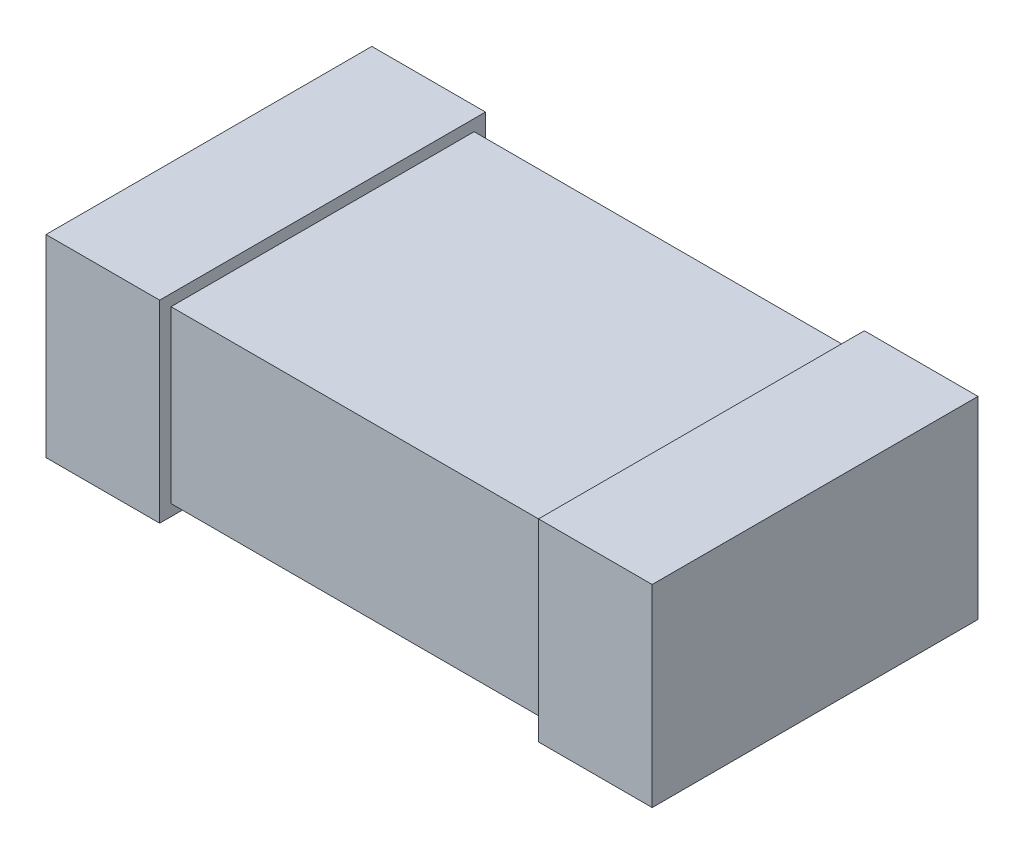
from build123d import *

# Parameters (mm, degrees)
SKETCH1_W           = 1.6
SKETCH1_H           = 0.8
EXTRUDE1_DEPTH      = 0.45
EXTRUDE2_DEPTH      = 0.43
EXTRUDE2_DEPTH_BACK = 0.43
SKETCH2_W           = 0.3
SKETCH2_H           = 0.51


with BuildPart() as part:
    # Sketch1 → Extrude1 (new body)
    with BuildSketch(Plane(origin=(0, 0, 0), x_dir=(1, 0, 0), z_dir=(0, 1, 0))):
        Rectangle(SKETCH1_W, SKETCH1_H)
    extrude(amount=EXTRUDE1_DEPTH)

    # Sketch2 → Extrude2 (add, two sides: drawn at the far end of the back side and taken through both)
    with BuildSketch(Plane.XY.offset(-EXTRUDE2_DEPTH_BACK)):
        with Locations((-0.65, 0.225)):
            Rectangle(SKETCH2_W, SKETCH2_H)
        with Locations((0.65, 0.225)):
            Rectangle(SKETCH2_W, SKETCH2_H)
    extrude(amount=EXTRUDE2_DEPTH + EXTRUDE2_DEPTH_BACK)


solid = part.part
